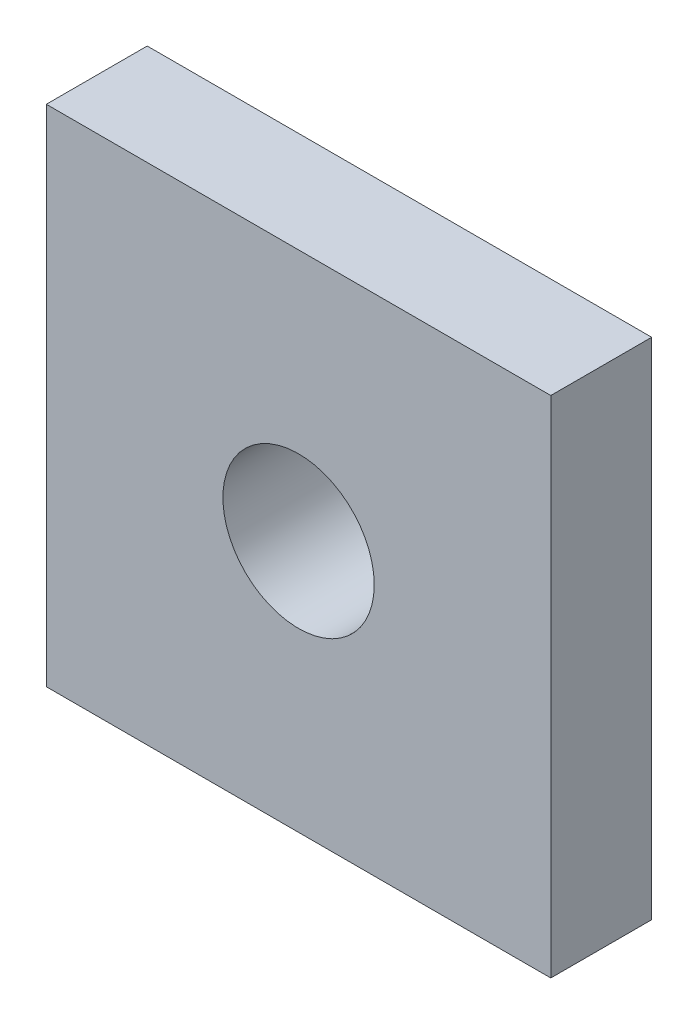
ISO-10303-21;
HEADER;
FILE_DESCRIPTION(('STEP AP214'),'2;1');
FILE_NAME('part.step','',(''),(''),'','','');
FILE_SCHEMA(('AUTOMOTIVE_DESIGN { 1 0 10303 214 1 1 1 1 }'));
ENDSEC;
DATA;
#1=APPLICATION_CONTEXT('core data for automotive mechanical design processes');
#2=APPLICATION_PROTOCOL_DEFINITION('international standard','automotive_design',2000,#1);
#3=PRODUCT_CONTEXT('',#1,'mechanical');
#4=PRODUCT('Part','Part','',(#3));
#5=PRODUCT_RELATED_PRODUCT_CATEGORY('part','',(#4));
#6=PRODUCT_DEFINITION_FORMATION('','',#4);
#7=PRODUCT_DEFINITION_CONTEXT('part definition',#1,'design');
#8=PRODUCT_DEFINITION('design','',#6,#7);
#9=PRODUCT_DEFINITION_SHAPE('','',#8);
#10=(LENGTH_UNIT() NAMED_UNIT(*) SI_UNIT(.MILLI.,.METRE.));
#11=(NAMED_UNIT(*) PLANE_ANGLE_UNIT() SI_UNIT($,.RADIAN.));
#12=(NAMED_UNIT(*) SI_UNIT($,.STERADIAN.) SOLID_ANGLE_UNIT());
#13=UNCERTAINTY_MEASURE_WITH_UNIT(LENGTH_MEASURE(1.E-05),#10,'distance_accuracy_value','');
#14=(GEOMETRIC_REPRESENTATION_CONTEXT(3) GLOBAL_UNCERTAINTY_ASSIGNED_CONTEXT((#13)) GLOBAL_UNIT_ASSIGNED_CONTEXT((#10,
#11,#12)) REPRESENTATION_CONTEXT('',''));
#15=CARTESIAN_POINT('',(0.,0.,0.));
#16=DIRECTION('',(0.,0.,1.));
#17=DIRECTION('',(1.,0.,0.));
#18=AXIS2_PLACEMENT_3D('',#15,#16,#17);
#19=CARTESIAN_POINT('',(50.,-50.,-20.));
#20=DIRECTION('',(1.,0.,0.));
#21=DIRECTION('',(0.,0.,-1.));
#22=AXIS2_PLACEMENT_3D('',#19,#20,#21);
#23=PLANE('',#22);
#24=DIRECTION('',(0.,1.,0.));
#25=VECTOR('',#24,1.);
#26=CARTESIAN_POINT('',(50.,-50.,0.));
#27=LINE('',#26,#25);
#28=CARTESIAN_POINT('',(50.,-50.,0.));
#29=VERTEX_POINT('',#28);
#30=CARTESIAN_POINT('',(50.,50.,0.));
#31=VERTEX_POINT('',#30);
#32=EDGE_CURVE('E104',#29,#31,#27,.T.);
#33=ORIENTED_EDGE('',*,*,#32,.F.);
#34=DIRECTION('',(0.,0.,1.));
#35=VECTOR('',#34,1.);
#36=CARTESIAN_POINT('',(50.,-50.,-20.));
#37=LINE('',#36,#35);
#38=CARTESIAN_POINT('',(50.,-50.,-20.));
#39=VERTEX_POINT('',#38);
#40=EDGE_CURVE('E48',#39,#29,#37,.T.);
#41=ORIENTED_EDGE('',*,*,#40,.F.);
#42=DIRECTION('',(0.,1.,0.));
#43=VECTOR('',#42,1.);
#44=CARTESIAN_POINT('',(50.,-50.,-20.));
#45=LINE('',#44,#43);
#46=CARTESIAN_POINT('',(50.,50.,-20.));
#47=VERTEX_POINT('',#46);
#48=EDGE_CURVE('E97',#39,#47,#45,.T.);
#49=ORIENTED_EDGE('',*,*,#48,.T.);
#50=DIRECTION('',(0.,0.,1.));
#51=VECTOR('',#50,1.);
#52=CARTESIAN_POINT('',(50.,50.,-20.));
#53=LINE('',#52,#51);
#54=EDGE_CURVE('E45',#47,#31,#53,.T.);
#55=ORIENTED_EDGE('',*,*,#54,.T.);
#56=EDGE_LOOP('',(#33,#41,#49,#55));
#57=FACE_BOUND('',#56,.T.);
#58=ADVANCED_FACE('F39',(#57),#23,.T.);
#59=CARTESIAN_POINT('',(-50.,-50.,-20.));
#60=DIRECTION('',(0.,-1.,0.));
#61=DIRECTION('',(0.,0.,-1.));
#62=AXIS2_PLACEMENT_3D('',#59,#60,#61);
#63=PLANE('',#62);
#64=DIRECTION('',(1.,0.,0.));
#65=VECTOR('',#64,1.);
#66=CARTESIAN_POINT('',(-50.,-50.,0.));
#67=LINE('',#66,#65);
#68=CARTESIAN_POINT('',(-50.,-50.,0.));
#69=VERTEX_POINT('',#68);
#70=EDGE_CURVE('E101',#69,#29,#67,.T.);
#71=ORIENTED_EDGE('',*,*,#70,.F.);
#72=DIRECTION('',(0.,0.,1.));
#73=VECTOR('',#72,1.);
#74=CARTESIAN_POINT('',(-50.,-50.,-20.));
#75=LINE('',#74,#73);
#76=CARTESIAN_POINT('',(-50.,-50.,-20.));
#77=VERTEX_POINT('',#76);
#78=EDGE_CURVE('E71',#77,#69,#75,.T.);
#79=ORIENTED_EDGE('',*,*,#78,.F.);
#80=DIRECTION('',(1.,0.,0.));
#81=VECTOR('',#80,1.);
#82=CARTESIAN_POINT('',(-50.,-50.,-20.));
#83=LINE('',#82,#81);
#84=EDGE_CURVE('E96',#77,#39,#83,.T.);
#85=ORIENTED_EDGE('',*,*,#84,.T.);
#86=ORIENTED_EDGE('',*,*,#40,.T.);
#87=EDGE_LOOP('',(#71,#79,#85,#86));
#88=FACE_BOUND('',#87,.T.);
#89=ADVANCED_FACE('F120',(#88),#63,.T.);
#90=CARTESIAN_POINT('',(-50.,-50.,-20.));
#91=DIRECTION('',(-1.,0.,0.));
#92=DIRECTION('',(0.,0.,1.));
#93=AXIS2_PLACEMENT_3D('',#90,#91,#92);
#94=PLANE('',#93);
#95=DIRECTION('',(0.,-1.,0.));
#96=VECTOR('',#95,1.);
#97=CARTESIAN_POINT('',(-50.,-50.,0.));
#98=LINE('',#97,#96);
#99=CARTESIAN_POINT('',(-50.,50.,0.));
#100=VERTEX_POINT('',#99);
#101=EDGE_CURVE('E93',#100,#69,#98,.T.);
#102=ORIENTED_EDGE('',*,*,#101,.F.);
#103=DIRECTION('',(0.,0.,1.));
#104=VECTOR('',#103,1.);
#105=CARTESIAN_POINT('',(-50.,50.,-20.));
#106=LINE('',#105,#104);
#107=CARTESIAN_POINT('',(-50.,50.,-20.));
#108=VERTEX_POINT('',#107);
#109=EDGE_CURVE('E88',#108,#100,#106,.T.);
#110=ORIENTED_EDGE('',*,*,#109,.F.);
#111=DIRECTION('',(0.,-1.,0.));
#112=VECTOR('',#111,1.);
#113=CARTESIAN_POINT('',(-50.,-50.,-20.));
#114=LINE('',#113,#112);
#115=EDGE_CURVE('E90',#108,#77,#114,.T.);
#116=ORIENTED_EDGE('',*,*,#115,.T.);
#117=ORIENTED_EDGE('',*,*,#78,.T.);
#118=EDGE_LOOP('',(#102,#110,#116,#117));
#119=FACE_BOUND('',#118,.T.);
#120=ADVANCED_FACE('F86',(#119),#94,.T.);
#121=CARTESIAN_POINT('',(-50.,50.,-20.));
#122=DIRECTION('',(0.,1.,0.));
#123=DIRECTION('',(0.,0.,1.));
#124=AXIS2_PLACEMENT_3D('',#121,#122,#123);
#125=PLANE('',#124);
#126=DIRECTION('',(-1.,0.,0.));
#127=VECTOR('',#126,1.);
#128=CARTESIAN_POINT('',(-50.,50.,0.));
#129=LINE('',#128,#127);
#130=EDGE_CURVE('E107',#31,#100,#129,.T.);
#131=ORIENTED_EDGE('',*,*,#130,.F.);
#132=ORIENTED_EDGE('',*,*,#54,.F.);
#133=DIRECTION('',(-1.,0.,0.));
#134=VECTOR('',#133,1.);
#135=CARTESIAN_POINT('',(-50.,50.,-20.));
#136=LINE('',#135,#134);
#137=EDGE_CURVE('E92',#47,#108,#136,.T.);
#138=ORIENTED_EDGE('',*,*,#137,.T.);
#139=ORIENTED_EDGE('',*,*,#109,.T.);
#140=EDGE_LOOP('',(#131,#132,#138,#139));
#141=FACE_BOUND('',#140,.T.);
#142=ADVANCED_FACE('F98',(#141),#125,.T.);
#143=CARTESIAN_POINT('',(0.,0.,-20.));
#144=DIRECTION('',(0.,0.,-1.));
#145=DIRECTION('',(-1.,0.,0.));
#146=AXIS2_PLACEMENT_3D('',#143,#144,#145);
#147=PLANE('',#146);
#148=CARTESIAN_POINT('',(0.,0.,-20.));
#149=DIRECTION('',(0.,0.,-1.));
#150=DIRECTION('',(-1.,0.,0.));
#151=AXIS2_PLACEMENT_3D('',#148,#149,#150);
#152=CIRCLE('',#151,30.);
#153=CARTESIAN_POINT('',(-30.,0.,-20.));
#154=VERTEX_POINT('',#153);
#155=EDGE_CURVE('E11',#154,#154,#152,.T.);
#156=ORIENTED_EDGE('',*,*,#155,.F.);
#157=EDGE_LOOP('',(#156));
#158=FACE_BOUND('',#157,.T.);
#159=ORIENTED_EDGE('',*,*,#48,.F.);
#160=ORIENTED_EDGE('',*,*,#84,.F.);
#161=ORIENTED_EDGE('',*,*,#115,.F.);
#162=ORIENTED_EDGE('',*,*,#137,.F.);
#163=EDGE_LOOP('',(#159,#160,#161,#162));
#164=FACE_BOUND('',#163,.T.);
#165=ADVANCED_FACE('F94',(#158,#164),#147,.T.);
#166=CARTESIAN_POINT('',(0.,0.,0.));
#167=DIRECTION('',(0.,0.,-1.));
#168=DIRECTION('',(-1.,0.,0.));
#169=AXIS2_PLACEMENT_3D('',#166,#167,#168);
#170=PLANE('',#169);
#171=CARTESIAN_POINT('',(0.,0.,0.));
#172=DIRECTION('',(0.,0.,1.));
#173=DIRECTION('',(1.,0.,0.));
#174=AXIS2_PLACEMENT_3D('',#171,#172,#173);
#175=CIRCLE('',#174,15.);
#176=CARTESIAN_POINT('',(15.,0.,0.));
#177=VERTEX_POINT('',#176);
#178=EDGE_CURVE('E158',#177,#177,#175,.T.);
#179=ORIENTED_EDGE('',*,*,#178,.F.);
#180=EDGE_LOOP('',(#179));
#181=FACE_BOUND('',#180,.T.);
#182=ORIENTED_EDGE('',*,*,#32,.T.);
#183=ORIENTED_EDGE('',*,*,#130,.T.);
#184=ORIENTED_EDGE('',*,*,#101,.T.);
#185=ORIENTED_EDGE('',*,*,#70,.T.);
#186=EDGE_LOOP('',(#182,#183,#184,#185));
#187=FACE_BOUND('',#186,.T.);
#188=ADVANCED_FACE('F117',(#181,#187),#170,.F.);
#189=CARTESIAN_POINT('',(0.,0.,-40.));
#190=DIRECTION('',(0.,0.,1.));
#191=DIRECTION('',(1.,0.,0.));
#192=AXIS2_PLACEMENT_3D('',#189,#190,#191);
#193=CYLINDRICAL_SURFACE('',#192,30.);
#194=ORIENTED_EDGE('',*,*,#155,.T.);
#195=EDGE_LOOP('',(#194));
#196=FACE_BOUND('',#195,.T.);
#197=CARTESIAN_POINT('',(0.,0.,-40.));
#198=DIRECTION('',(0.,0.,1.));
#199=DIRECTION('',(1.,0.,0.));
#200=AXIS2_PLACEMENT_3D('',#197,#198,#199);
#201=CIRCLE('',#200,30.);
#202=CARTESIAN_POINT('',(30.,0.,-40.));
#203=VERTEX_POINT('',#202);
#204=EDGE_CURVE('E108',#203,#203,#201,.T.);
#205=ORIENTED_EDGE('',*,*,#204,.T.);
#206=EDGE_LOOP('',(#205));
#207=FACE_BOUND('',#206,.T.);
#208=ADVANCED_FACE('F137',(#196,#207),#193,.T.);
#209=CARTESIAN_POINT('',(0.,0.,-40.));
#210=DIRECTION('',(0.,0.,1.));
#211=DIRECTION('',(1.,0.,0.));
#212=AXIS2_PLACEMENT_3D('',#209,#210,#211);
#213=PLANE('',#212);
#214=ORIENTED_EDGE('',*,*,#204,.F.);
#215=EDGE_LOOP('',(#214));
#216=FACE_BOUND('',#215,.T.);
#217=ADVANCED_FACE('F143',(#216),#213,.F.);
#218=CARTESIAN_POINT('',(0.,0.,-30.));
#219=DIRECTION('',(0.,0.,1.));
#220=DIRECTION('',(1.,0.,0.));
#221=AXIS2_PLACEMENT_3D('',#218,#219,#220);
#222=CYLINDRICAL_SURFACE('',#221,15.);
#223=CARTESIAN_POINT('',(0.,0.,-30.));
#224=DIRECTION('',(0.,0.,1.));
#225=DIRECTION('',(1.,0.,0.));
#226=AXIS2_PLACEMENT_3D('',#223,#224,#225);
#227=CIRCLE('',#226,15.);
#228=CARTESIAN_POINT('',(15.,0.,-30.));
#229=VERTEX_POINT('',#228);
#230=EDGE_CURVE('E160',#229,#229,#227,.T.);
#231=ORIENTED_EDGE('',*,*,#230,.F.);
#232=EDGE_LOOP('',(#231));
#233=FACE_BOUND('',#232,.T.);
#234=ORIENTED_EDGE('',*,*,#178,.T.);
#235=EDGE_LOOP('',(#234));
#236=FACE_BOUND('',#235,.T.);
#237=ADVANCED_FACE('F144',(#233,#236),#222,.F.);
#238=CARTESIAN_POINT('',(0.,0.,-30.));
#239=DIRECTION('',(0.,0.,1.));
#240=DIRECTION('',(1.,0.,0.));
#241=AXIS2_PLACEMENT_3D('',#238,#239,#240);
#242=PLANE('',#241);
#243=ORIENTED_EDGE('',*,*,#230,.T.);
#244=EDGE_LOOP('',(#243));
#245=FACE_BOUND('',#244,.T.);
#246=ADVANCED_FACE('F149',(#245),#242,.T.);
#247=CLOSED_SHELL('',(#58,#89,#120,#142,#165,#188,#208,#217,#237,#246));
#248=MANIFOLD_SOLID_BREP('B2',#247);
#249=ADVANCED_BREP_SHAPE_REPRESENTATION('',(#18,#248),#14);
#250=SHAPE_DEFINITION_REPRESENTATION(#9,#249);
ENDSEC;
END-ISO-10303-21;
